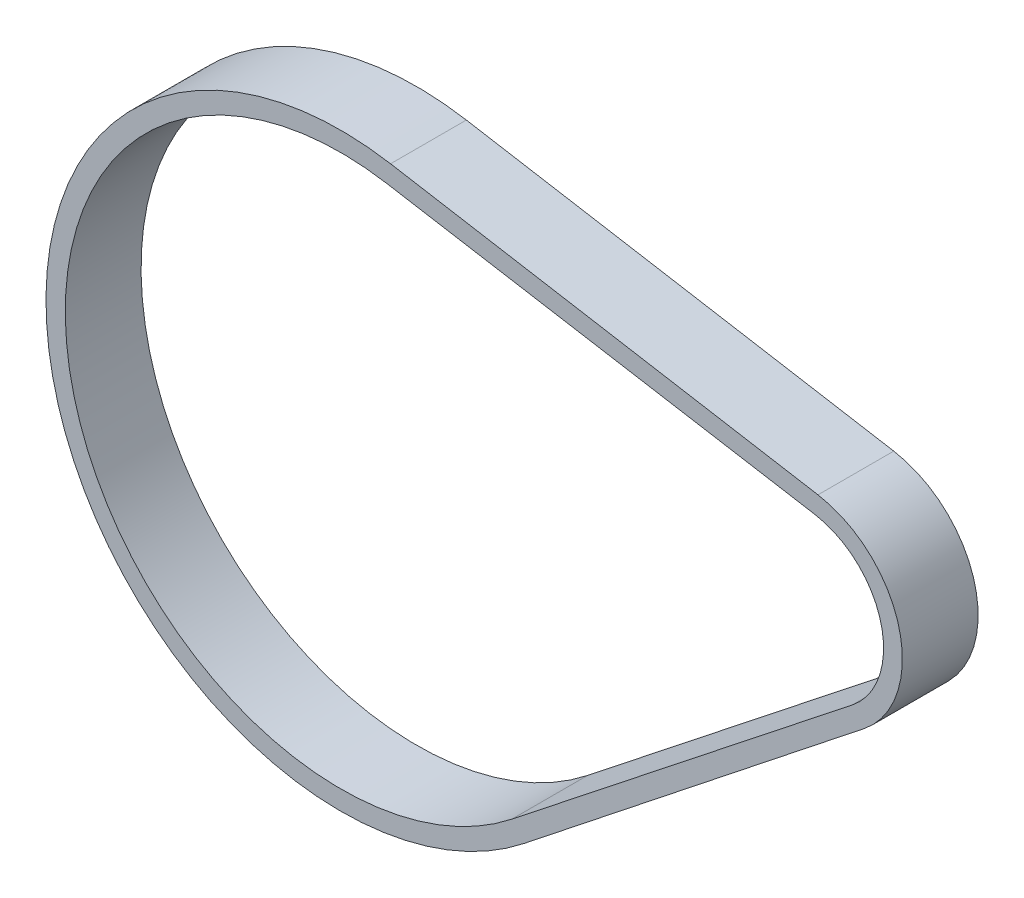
ISO-10303-21;
HEADER;
FILE_DESCRIPTION(('STEP AP214'),'2;1');
FILE_NAME('part.step','',(''),(''),'','','');
FILE_SCHEMA(('AUTOMOTIVE_DESIGN { 1 0 10303 214 1 1 1 1 }'));
ENDSEC;
DATA;
#1=APPLICATION_CONTEXT('core data for automotive mechanical design processes');
#2=APPLICATION_PROTOCOL_DEFINITION('international standard','automotive_design',2000,#1);
#3=PRODUCT_CONTEXT('',#1,'mechanical');
#4=PRODUCT('Part','Part','',(#3));
#5=PRODUCT_RELATED_PRODUCT_CATEGORY('part','',(#4));
#6=PRODUCT_DEFINITION_FORMATION('','',#4);
#7=PRODUCT_DEFINITION_CONTEXT('part definition',#1,'design');
#8=PRODUCT_DEFINITION('design','',#6,#7);
#9=PRODUCT_DEFINITION_SHAPE('','',#8);
#10=(LENGTH_UNIT() NAMED_UNIT(*) SI_UNIT(.MILLI.,.METRE.));
#11=(NAMED_UNIT(*) PLANE_ANGLE_UNIT() SI_UNIT($,.RADIAN.));
#12=(NAMED_UNIT(*) SI_UNIT($,.STERADIAN.) SOLID_ANGLE_UNIT());
#13=UNCERTAINTY_MEASURE_WITH_UNIT(LENGTH_MEASURE(1.E-05),#10,'distance_accuracy_value','');
#14=(GEOMETRIC_REPRESENTATION_CONTEXT(3) GLOBAL_UNCERTAINTY_ASSIGNED_CONTEXT((#13)) GLOBAL_UNIT_ASSIGNED_CONTEXT((#10,
#11,#12)) REPRESENTATION_CONTEXT('',''));
#15=CARTESIAN_POINT('',(0.,0.,0.));
#16=DIRECTION('',(0.,0.,1.));
#17=DIRECTION('',(1.,0.,0.));
#18=AXIS2_PLACEMENT_3D('',#15,#16,#17);
#19=CARTESIAN_POINT('',(0.,0.,28.));
#20=DIRECTION('',(0.,0.,1.));
#21=DIRECTION('',(1.,0.,0.));
#22=AXIS2_PLACEMENT_3D('',#19,#20,#21);
#23=PLANE('',#22);
#24=CARTESIAN_POINT('',(0.,0.,28.));
#25=DIRECTION('',(0.,0.,1.));
#26=DIRECTION('',(1.,0.,0.));
#27=AXIS2_PLACEMENT_3D('',#24,#25,#26);
#28=CIRCLE('',#27,109.);
#29=CARTESIAN_POINT('',(18.3510639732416,107.444117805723,28.));
#30=VERTEX_POINT('',#29);
#31=CARTESIAN_POINT('',(67.7027320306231,-85.4244700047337,28.));
#32=VERTEX_POINT('',#31);
#33=EDGE_CURVE('E142',#30,#32,#28,.T.);
#34=ORIENTED_EDGE('',*,*,#33,.T.);
#35=DIRECTION('',(0.783710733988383,0.621125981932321,0.));
#36=VECTOR('',#35,1.);
#37=CARTESIAN_POINT('',(67.7027320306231,-85.4244700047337,28.));
#38=LINE('',#37,#36);
#39=CARTESIAN_POINT('',(193.292224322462,14.1108474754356,28.));
#40=VERTEX_POINT('',#39);
#41=EDGE_CURVE('E145',#32,#40,#38,.T.);
#42=ORIENTED_EDGE('',*,*,#41,.T.);
#43=CARTESIAN_POINT('',(170.,43.5,28.));
#44=DIRECTION('',(0.,0.,1.));
#45=DIRECTION('',(1.,0.,0.));
#46=AXIS2_PLACEMENT_3D('',#43,#44,#45);
#47=CIRCLE('',#46,37.5);
#48=CARTESIAN_POINT('',(176.313439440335,80.4647194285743,28.));
#49=VERTEX_POINT('',#48);
#50=EDGE_CURVE('E147',#40,#49,#47,.T.);
#51=ORIENTED_EDGE('',*,*,#50,.T.);
#52=DIRECTION('',(0.985725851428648,-0.168358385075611,0.));
#53=VECTOR('',#52,1.);
#54=CARTESIAN_POINT('',(18.3510639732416,107.444117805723,28.));
#55=LINE('',#54,#53);
#56=EDGE_CURVE('E149',#30,#49,#55,.T.);
#57=ORIENTED_EDGE('',*,*,#56,.F.);
#58=EDGE_LOOP('',(#34,#42,#51,#57));
#59=FACE_BOUND('',#58,.T.);
#60=CARTESIAN_POINT('',(170.,43.5,28.));
#61=DIRECTION('',(0.,0.,1.));
#62=DIRECTION('',(1.,0.,0.));
#63=AXIS2_PLACEMENT_3D('',#60,#61,#62);
#64=CIRCLE('',#63,30.56);
#65=CARTESIAN_POINT('',(188.951712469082,19.5261351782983,28.));
#66=VERTEX_POINT('',#65);
#67=CARTESIAN_POINT('',(175.107442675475,73.6301780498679,28.));
#68=VERTEX_POINT('',#67);
#69=EDGE_CURVE('E123',#66,#68,#64,.T.);
#70=ORIENTED_EDGE('',*,*,#69,.F.);
#71=DIRECTION('',(0.784485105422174,0.620147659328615,0.));
#72=VECTOR('',#71,1.);
#73=CARTESIAN_POINT('',(63.1682405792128,-79.9076528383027,28.));
#74=LINE('',#73,#72);
#75=CARTESIAN_POINT('',(63.1682405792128,-79.9076528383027,28.));
#76=VERTEX_POINT('',#75);
#77=EDGE_CURVE('E121',#76,#66,#74,.T.);
#78=ORIENTED_EDGE('',*,*,#77,.F.);
#79=CARTESIAN_POINT('',(0.,0.,28.));
#80=DIRECTION('',(0.,0.,1.));
#81=DIRECTION('',(1.,0.,0.));
#82=AXIS2_PLACEMENT_3D('',#79,#80,#81);
#83=CIRCLE('',#82,101.86);
#84=CARTESIAN_POINT('',(17.0236947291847,100.427353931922,28.));
#85=VERTEX_POINT('',#84);
#86=EDGE_CURVE('E110',#85,#76,#83,.T.);
#87=ORIENTED_EDGE('',*,*,#86,.F.);
#88=DIRECTION('',(0.985935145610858,-0.167128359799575,0.));
#89=VECTOR('',#88,1.);
#90=CARTESIAN_POINT('',(17.0236947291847,100.427353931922,28.));
#91=LINE('',#90,#89);
#92=EDGE_CURVE('E125',#85,#68,#91,.T.);
#93=ORIENTED_EDGE('',*,*,#92,.T.);
#94=EDGE_LOOP('',(#70,#78,#87,#93));
#95=FACE_BOUND('',#94,.T.);
#96=ADVANCED_FACE('F30',(#59,#95),#23,.T.);
#97=CARTESIAN_POINT('',(0.,0.,0.));
#98=DIRECTION('',(0.,0.,1.));
#99=DIRECTION('',(1.,0.,0.));
#100=AXIS2_PLACEMENT_3D('',#97,#98,#99);
#101=PLANE('',#100);
#102=CARTESIAN_POINT('',(0.,0.,0.));
#103=DIRECTION('',(0.,0.,1.));
#104=DIRECTION('',(1.,0.,0.));
#105=AXIS2_PLACEMENT_3D('',#102,#103,#104);
#106=CIRCLE('',#105,109.);
#107=CARTESIAN_POINT('',(18.3510639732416,107.444117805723,0.));
#108=VERTEX_POINT('',#107);
#109=CARTESIAN_POINT('',(67.7027320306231,-85.4244700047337,0.));
#110=VERTEX_POINT('',#109);
#111=EDGE_CURVE('E111',#108,#110,#106,.T.);
#112=ORIENTED_EDGE('',*,*,#111,.F.);
#113=DIRECTION('',(0.985725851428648,-0.168358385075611,0.));
#114=VECTOR('',#113,1.);
#115=CARTESIAN_POINT('',(18.3510639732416,107.444117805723,0.));
#116=LINE('',#115,#114);
#117=CARTESIAN_POINT('',(176.313439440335,80.4647194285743,0.));
#118=VERTEX_POINT('',#117);
#119=EDGE_CURVE('E139',#108,#118,#116,.T.);
#120=ORIENTED_EDGE('',*,*,#119,.T.);
#121=CARTESIAN_POINT('',(170.,43.5,0.));
#122=DIRECTION('',(0.,0.,1.));
#123=DIRECTION('',(1.,0.,0.));
#124=AXIS2_PLACEMENT_3D('',#121,#122,#123);
#125=CIRCLE('',#124,37.5);
#126=CARTESIAN_POINT('',(193.292224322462,14.1108474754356,0.));
#127=VERTEX_POINT('',#126);
#128=EDGE_CURVE('E136',#127,#118,#125,.T.);
#129=ORIENTED_EDGE('',*,*,#128,.F.);
#130=DIRECTION('',(0.783710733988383,0.621125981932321,0.));
#131=VECTOR('',#130,1.);
#132=CARTESIAN_POINT('',(67.7027320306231,-85.4244700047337,0.));
#133=LINE('',#132,#131);
#134=EDGE_CURVE('E134',#110,#127,#133,.T.);
#135=ORIENTED_EDGE('',*,*,#134,.F.);
#136=EDGE_LOOP('',(#112,#120,#129,#135));
#137=FACE_BOUND('',#136,.T.);
#138=CARTESIAN_POINT('',(0.,0.,0.));
#139=DIRECTION('',(0.,0.,1.));
#140=DIRECTION('',(1.,0.,0.));
#141=AXIS2_PLACEMENT_3D('',#138,#139,#140);
#142=CIRCLE('',#141,101.86);
#143=CARTESIAN_POINT('',(17.0236947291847,100.427353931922,0.));
#144=VERTEX_POINT('',#143);
#145=CARTESIAN_POINT('',(63.1682405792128,-79.9076528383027,0.));
#146=VERTEX_POINT('',#145);
#147=EDGE_CURVE('E53',#144,#146,#142,.T.);
#148=ORIENTED_EDGE('',*,*,#147,.T.);
#149=DIRECTION('',(0.784485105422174,0.620147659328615,0.));
#150=VECTOR('',#149,1.);
#151=CARTESIAN_POINT('',(63.1682405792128,-79.9076528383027,0.));
#152=LINE('',#151,#150);
#153=CARTESIAN_POINT('',(188.951712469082,19.5261351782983,0.));
#154=VERTEX_POINT('',#153);
#155=EDGE_CURVE('E97',#146,#154,#152,.T.);
#156=ORIENTED_EDGE('',*,*,#155,.T.);
#157=CARTESIAN_POINT('',(170.,43.5,0.));
#158=DIRECTION('',(0.,0.,1.));
#159=DIRECTION('',(1.,0.,0.));
#160=AXIS2_PLACEMENT_3D('',#157,#158,#159);
#161=CIRCLE('',#160,30.56);
#162=CARTESIAN_POINT('',(175.107442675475,73.6301780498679,0.));
#163=VERTEX_POINT('',#162);
#164=EDGE_CURVE('E106',#154,#163,#161,.T.);
#165=ORIENTED_EDGE('',*,*,#164,.T.);
#166=DIRECTION('',(0.985935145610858,-0.167128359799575,0.));
#167=VECTOR('',#166,1.);
#168=CARTESIAN_POINT('',(17.0236947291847,100.427353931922,0.));
#169=LINE('',#168,#167);
#170=EDGE_CURVE('E115',#144,#163,#169,.T.);
#171=ORIENTED_EDGE('',*,*,#170,.F.);
#172=EDGE_LOOP('',(#148,#156,#165,#171));
#173=FACE_BOUND('',#172,.T.);
#174=ADVANCED_FACE('F114',(#137,#173),#101,.F.);
#175=CARTESIAN_POINT('',(0.,0.,28.));
#176=DIRECTION('',(0.,0.,-1.));
#177=DIRECTION('',(-1.,0.,0.));
#178=AXIS2_PLACEMENT_3D('',#175,#176,#177);
#179=CYLINDRICAL_SURFACE('',#178,109.);
#180=ORIENTED_EDGE('',*,*,#111,.T.);
#181=DIRECTION('',(0.,0.,-1.));
#182=VECTOR('',#181,1.);
#183=CARTESIAN_POINT('',(67.7027320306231,-85.4244700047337,28.));
#184=LINE('',#183,#182);
#185=EDGE_CURVE('E11',#32,#110,#184,.T.);
#186=ORIENTED_EDGE('',*,*,#185,.F.);
#187=ORIENTED_EDGE('',*,*,#33,.F.);
#188=DIRECTION('',(0.,0.,-1.));
#189=VECTOR('',#188,1.);
#190=CARTESIAN_POINT('',(18.3510639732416,107.444117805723,28.));
#191=LINE('',#190,#189);
#192=EDGE_CURVE('E152',#30,#108,#191,.T.);
#193=ORIENTED_EDGE('',*,*,#192,.T.);
#194=EDGE_LOOP('',(#180,#186,#187,#193));
#195=FACE_BOUND('',#194,.T.);
#196=ADVANCED_FACE('F32',(#195),#179,.T.);
#197=CARTESIAN_POINT('',(67.7027320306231,-85.4244700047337,28.));
#198=DIRECTION('',(-0.621125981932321,0.783710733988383,0.));
#199=DIRECTION('',(-0.783710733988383,-0.621125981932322,0.));
#200=AXIS2_PLACEMENT_3D('',#197,#198,#199);
#201=PLANE('',#200);
#202=ORIENTED_EDGE('',*,*,#134,.T.);
#203=DIRECTION('',(0.,0.,-1.));
#204=VECTOR('',#203,1.);
#205=CARTESIAN_POINT('',(193.292224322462,14.1108474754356,28.));
#206=LINE('',#205,#204);
#207=EDGE_CURVE('E38',#40,#127,#206,.T.);
#208=ORIENTED_EDGE('',*,*,#207,.F.);
#209=ORIENTED_EDGE('',*,*,#41,.F.);
#210=ORIENTED_EDGE('',*,*,#185,.T.);
#211=EDGE_LOOP('',(#202,#208,#209,#210));
#212=FACE_BOUND('',#211,.T.);
#213=ADVANCED_FACE('F173',(#212),#201,.F.);
#214=CARTESIAN_POINT('',(170.,43.5,28.));
#215=DIRECTION('',(0.,0.,-1.));
#216=DIRECTION('',(-1.,0.,0.));
#217=AXIS2_PLACEMENT_3D('',#214,#215,#216);
#218=CYLINDRICAL_SURFACE('',#217,37.5);
#219=ORIENTED_EDGE('',*,*,#128,.T.);
#220=DIRECTION('',(0.,0.,-1.));
#221=VECTOR('',#220,1.);
#222=CARTESIAN_POINT('',(176.313439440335,80.4647194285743,28.));
#223=LINE('',#222,#221);
#224=EDGE_CURVE('E154',#49,#118,#223,.T.);
#225=ORIENTED_EDGE('',*,*,#224,.F.);
#226=ORIENTED_EDGE('',*,*,#50,.F.);
#227=ORIENTED_EDGE('',*,*,#207,.T.);
#228=EDGE_LOOP('',(#219,#225,#226,#227));
#229=FACE_BOUND('',#228,.T.);
#230=ADVANCED_FACE('F160',(#229),#218,.T.);
#231=CARTESIAN_POINT('',(18.3510639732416,107.444117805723,28.));
#232=DIRECTION('',(0.168358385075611,0.985725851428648,0.));
#233=DIRECTION('',(-0.985725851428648,0.168358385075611,0.));
#234=AXIS2_PLACEMENT_3D('',#231,#232,#233);
#235=PLANE('',#234);
#236=ORIENTED_EDGE('',*,*,#119,.F.);
#237=ORIENTED_EDGE('',*,*,#192,.F.);
#238=ORIENTED_EDGE('',*,*,#56,.T.);
#239=ORIENTED_EDGE('',*,*,#224,.T.);
#240=EDGE_LOOP('',(#236,#237,#238,#239));
#241=FACE_BOUND('',#240,.T.);
#242=ADVANCED_FACE('F167',(#241),#235,.T.);
#243=CARTESIAN_POINT('',(0.,0.,28.));
#244=DIRECTION('',(0.,0.,-1.));
#245=DIRECTION('',(-1.,0.,0.));
#246=AXIS2_PLACEMENT_3D('',#243,#244,#245);
#247=CYLINDRICAL_SURFACE('',#246,101.86);
#248=ORIENTED_EDGE('',*,*,#147,.F.);
#249=DIRECTION('',(0.,0.,-1.));
#250=VECTOR('',#249,1.);
#251=CARTESIAN_POINT('',(17.0236947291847,100.427353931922,28.));
#252=LINE('',#251,#250);
#253=EDGE_CURVE('E128',#85,#144,#252,.T.);
#254=ORIENTED_EDGE('',*,*,#253,.F.);
#255=ORIENTED_EDGE('',*,*,#86,.T.);
#256=DIRECTION('',(0.,0.,-1.));
#257=VECTOR('',#256,1.);
#258=CARTESIAN_POINT('',(63.1682405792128,-79.9076528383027,28.));
#259=LINE('',#258,#257);
#260=EDGE_CURVE('E99',#76,#146,#259,.T.);
#261=ORIENTED_EDGE('',*,*,#260,.T.);
#262=EDGE_LOOP('',(#248,#254,#255,#261));
#263=FACE_BOUND('',#262,.T.);
#264=ADVANCED_FACE('F108',(#263),#247,.F.);
#265=CARTESIAN_POINT('',(63.1682405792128,-79.9076528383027,28.));
#266=DIRECTION('',(-0.620147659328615,0.784485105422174,0.));
#267=DIRECTION('',(-0.784485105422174,-0.620147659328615,0.));
#268=AXIS2_PLACEMENT_3D('',#265,#266,#267);
#269=PLANE('',#268);
#270=ORIENTED_EDGE('',*,*,#155,.F.);
#271=ORIENTED_EDGE('',*,*,#260,.F.);
#272=ORIENTED_EDGE('',*,*,#77,.T.);
#273=DIRECTION('',(0.,0.,-1.));
#274=VECTOR('',#273,1.);
#275=CARTESIAN_POINT('',(188.951712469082,19.5261351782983,28.));
#276=LINE('',#275,#274);
#277=EDGE_CURVE('E102',#66,#154,#276,.T.);
#278=ORIENTED_EDGE('',*,*,#277,.T.);
#279=EDGE_LOOP('',(#270,#271,#272,#278));
#280=FACE_BOUND('',#279,.T.);
#281=ADVANCED_FACE('F98',(#280),#269,.T.);
#282=CARTESIAN_POINT('',(170.,43.5,28.));
#283=DIRECTION('',(0.,0.,-1.));
#284=DIRECTION('',(-1.,0.,0.));
#285=AXIS2_PLACEMENT_3D('',#282,#283,#284);
#286=CYLINDRICAL_SURFACE('',#285,30.56);
#287=ORIENTED_EDGE('',*,*,#164,.F.);
#288=ORIENTED_EDGE('',*,*,#277,.F.);
#289=ORIENTED_EDGE('',*,*,#69,.T.);
#290=DIRECTION('',(0.,0.,-1.));
#291=VECTOR('',#290,1.);
#292=CARTESIAN_POINT('',(175.107442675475,73.6301780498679,28.));
#293=LINE('',#292,#291);
#294=EDGE_CURVE('E45',#68,#163,#293,.T.);
#295=ORIENTED_EDGE('',*,*,#294,.T.);
#296=EDGE_LOOP('',(#287,#288,#289,#295));
#297=FACE_BOUND('',#296,.T.);
#298=ADVANCED_FACE('F209',(#297),#286,.F.);
#299=CARTESIAN_POINT('',(17.0236947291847,100.427353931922,28.));
#300=DIRECTION('',(0.167128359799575,0.985935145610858,0.));
#301=DIRECTION('',(-0.985935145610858,0.167128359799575,0.));
#302=AXIS2_PLACEMENT_3D('',#299,#300,#301);
#303=PLANE('',#302);
#304=ORIENTED_EDGE('',*,*,#170,.T.);
#305=ORIENTED_EDGE('',*,*,#294,.F.);
#306=ORIENTED_EDGE('',*,*,#92,.F.);
#307=ORIENTED_EDGE('',*,*,#253,.T.);
#308=EDGE_LOOP('',(#304,#305,#306,#307));
#309=FACE_BOUND('',#308,.T.);
#310=ADVANCED_FACE('F216',(#309),#303,.F.);
#311=CLOSED_SHELL('',(#96,#174,#196,#213,#230,#242,#264,#281,#298,#310));
#312=MANIFOLD_SOLID_BREP('B2',#311);
#313=ADVANCED_BREP_SHAPE_REPRESENTATION('',(#18,#312),#14);
#314=SHAPE_DEFINITION_REPRESENTATION(#9,#313);
ENDSEC;
END-ISO-10303-21;
